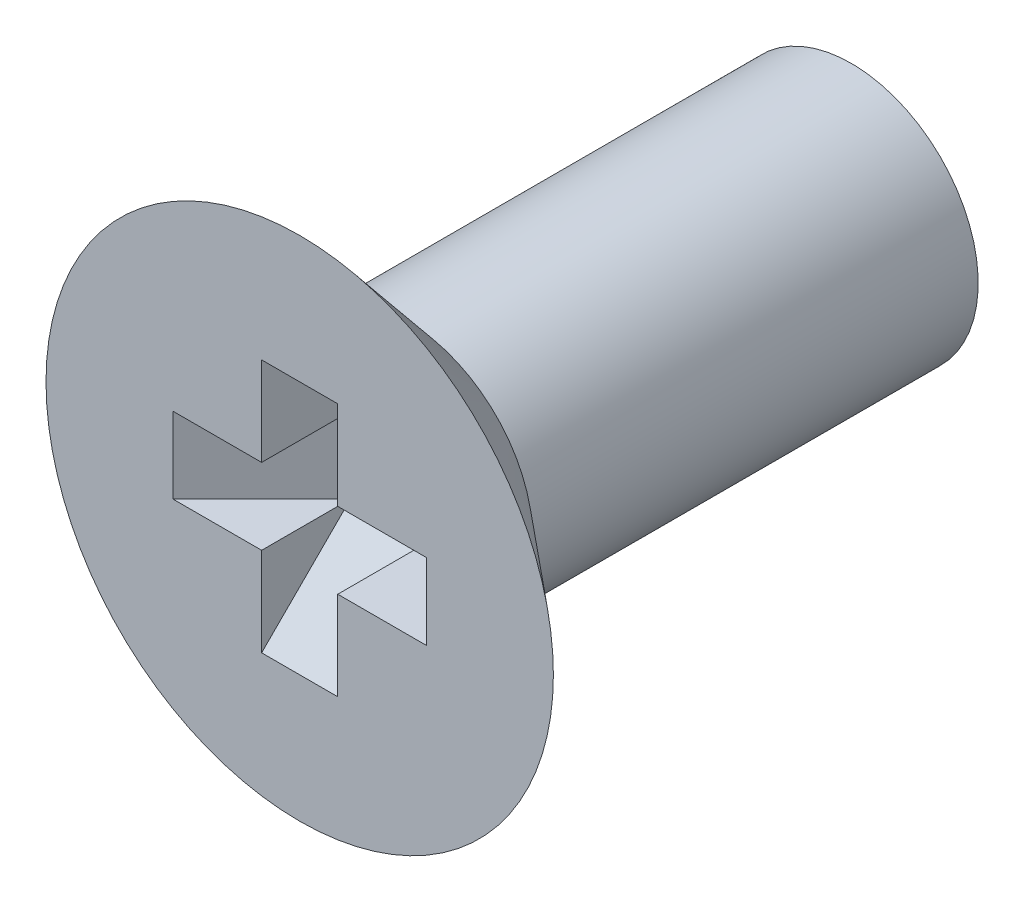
ISO-10303-21;
HEADER;
FILE_DESCRIPTION(('STEP AP214'),'2;1');
FILE_NAME('part.step','',(''),(''),'','','');
FILE_SCHEMA(('AUTOMOTIVE_DESIGN { 1 0 10303 214 1 1 1 1 }'));
ENDSEC;
DATA;
#1=APPLICATION_CONTEXT('core data for automotive mechanical design processes');
#2=APPLICATION_PROTOCOL_DEFINITION('international standard','automotive_design',2000,#1);
#3=PRODUCT_CONTEXT('',#1,'mechanical');
#4=PRODUCT('Part','Part','',(#3));
#5=PRODUCT_RELATED_PRODUCT_CATEGORY('part','',(#4));
#6=PRODUCT_DEFINITION_FORMATION('','',#4);
#7=PRODUCT_DEFINITION_CONTEXT('part definition',#1,'design');
#8=PRODUCT_DEFINITION('design','',#6,#7);
#9=PRODUCT_DEFINITION_SHAPE('','',#8);
#10=(LENGTH_UNIT() NAMED_UNIT(*) SI_UNIT(.MILLI.,.METRE.));
#11=(NAMED_UNIT(*) PLANE_ANGLE_UNIT() SI_UNIT($,.RADIAN.));
#12=(NAMED_UNIT(*) SI_UNIT($,.STERADIAN.) SOLID_ANGLE_UNIT());
#13=UNCERTAINTY_MEASURE_WITH_UNIT(LENGTH_MEASURE(1.E-05),#10,'distance_accuracy_value','');
#14=(GEOMETRIC_REPRESENTATION_CONTEXT(3) GLOBAL_UNCERTAINTY_ASSIGNED_CONTEXT((#13)) GLOBAL_UNIT_ASSIGNED_CONTEXT((#10,
#11,#12)) REPRESENTATION_CONTEXT('',''));
#15=CARTESIAN_POINT('',(0.,0.,0.));
#16=DIRECTION('',(0.,0.,1.));
#17=DIRECTION('',(1.,0.,0.));
#18=AXIS2_PLACEMENT_3D('',#15,#16,#17);
#19=CARTESIAN_POINT('',(-0.32766,-0.327659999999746,-0.76454));
#20=DIRECTION('',(0.,0.,-1.));
#21=DIRECTION('',(-1.,0.,0.));
#22=AXIS2_PLACEMENT_3D('',#19,#20,#21);
#23=PLANE('',#22);
#24=DIRECTION('',(0.,1.,0.));
#25=VECTOR('',#24,1.);
#26=CARTESIAN_POINT('',(0.32766,-0.32766,-0.76454));
#27=LINE('',#26,#25);
#28=CARTESIAN_POINT('',(0.32766,-0.327659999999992,-0.764539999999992));
#29=VERTEX_POINT('',#28);
#30=CARTESIAN_POINT('',(0.32766,0.327660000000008,-0.764540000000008));
#31=VERTEX_POINT('',#30);
#32=EDGE_CURVE('E87',#29,#31,#27,.T.);
#33=ORIENTED_EDGE('',*,*,#32,.T.);
#34=DIRECTION('',(1.,0.,0.));
#35=VECTOR('',#34,1.);
#36=CARTESIAN_POINT('',(-0.32766,0.327660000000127,-0.764540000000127));
#37=LINE('',#36,#35);
#38=CARTESIAN_POINT('',(-0.32766,0.327660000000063,-0.764540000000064));
#39=VERTEX_POINT('',#38);
#40=EDGE_CURVE('E174',#31,#39,#37,.F.);
#41=ORIENTED_EDGE('',*,*,#40,.T.);
#42=DIRECTION('',(0.,1.,0.));
#43=VECTOR('',#42,1.);
#44=CARTESIAN_POINT('',(-0.32766,-0.32766,-0.76454));
#45=LINE('',#44,#43);
#46=CARTESIAN_POINT('',(-0.32766,-0.327659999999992,-0.764539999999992));
#47=VERTEX_POINT('',#46);
#48=EDGE_CURVE('E114',#39,#47,#45,.F.);
#49=ORIENTED_EDGE('',*,*,#48,.T.);
#50=DIRECTION('',(1.,0.,0.));
#51=VECTOR('',#50,1.);
#52=CARTESIAN_POINT('',(-0.32766,-0.327659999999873,-0.764539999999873));
#53=LINE('',#52,#51);
#54=EDGE_CURVE('E111',#47,#29,#53,.T.);
#55=ORIENTED_EDGE('',*,*,#54,.T.);
#56=EDGE_LOOP('',(#33,#41,#49,#55));
#57=FACE_BOUND('',#56,.T.);
#58=ADVANCED_FACE('F24',(#57),#23,.F.);
#59=CARTESIAN_POINT('',(0.,-0.32766,0.));
#60=DIRECTION('',(0.,1.,0.));
#61=DIRECTION('',(0.,0.,1.));
#62=AXIS2_PLACEMENT_3D('',#59,#60,#61);
#63=PLANE('',#62);
#64=DIRECTION('',(0.,0.,-1.));
#65=VECTOR('',#64,1.);
#66=CARTESIAN_POINT('',(0.32766,-0.32766,0.));
#67=LINE('',#66,#65);
#68=CARTESIAN_POINT('',(0.32766,-0.32766,0.));
#69=VERTEX_POINT('',#68);
#70=EDGE_CURVE('E95',#29,#69,#67,.F.);
#71=ORIENTED_EDGE('',*,*,#70,.T.);
#72=DIRECTION('',(-1.,0.,0.));
#73=VECTOR('',#72,1.);
#74=CARTESIAN_POINT('',(0.,-0.32766,0.));
#75=LINE('',#74,#73);
#76=CARTESIAN_POINT('',(1.0922,-0.32766,0.));
#77=VERTEX_POINT('',#76);
#78=EDGE_CURVE('E98',#69,#77,#75,.F.);
#79=ORIENTED_EDGE('',*,*,#78,.T.);
#80=DIRECTION('',(-0.707106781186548,0.,-0.707106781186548));
#81=VECTOR('',#80,1.);
#82=CARTESIAN_POINT('',(1.0922,-0.32766,0.));
#83=LINE('',#82,#81);
#84=EDGE_CURVE('E92',#77,#29,#83,.T.);
#85=ORIENTED_EDGE('',*,*,#84,.T.);
#86=EDGE_LOOP('',(#71,#79,#85));
#87=FACE_BOUND('',#86,.T.);
#88=ADVANCED_FACE('F94',(#87),#63,.T.);
#89=CARTESIAN_POINT('',(1.0922,-0.32766,0.));
#90=DIRECTION('',(0.707106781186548,0.,-0.707106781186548));
#91=DIRECTION('',(-0.707106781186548,0.,-0.707106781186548));
#92=AXIS2_PLACEMENT_3D('',#89,#90,#91);
#93=PLANE('',#92);
#94=ORIENTED_EDGE('',*,*,#32,.F.);
#95=ORIENTED_EDGE('',*,*,#84,.F.);
#96=DIRECTION('',(0.,1.,0.));
#97=VECTOR('',#96,1.);
#98=CARTESIAN_POINT('',(1.0922,0.,0.));
#99=LINE('',#98,#97);
#100=CARTESIAN_POINT('',(1.0922,0.32766,0.));
#101=VERTEX_POINT('',#100);
#102=EDGE_CURVE('E151',#77,#101,#99,.T.);
#103=ORIENTED_EDGE('',*,*,#102,.T.);
#104=DIRECTION('',(-0.707106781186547,0.,-0.707106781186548));
#105=VECTOR('',#104,1.);
#106=CARTESIAN_POINT('',(1.0922,0.32766,0.));
#107=LINE('',#106,#105);
#108=EDGE_CURVE('E120',#101,#31,#107,.T.);
#109=ORIENTED_EDGE('',*,*,#108,.T.);
#110=EDGE_LOOP('',(#94,#95,#103,#109));
#111=FACE_BOUND('',#110,.T.);
#112=ADVANCED_FACE('F118',(#111),#93,.F.);
#113=CARTESIAN_POINT('',(0.,0.32766,0.));
#114=DIRECTION('',(0.,1.,0.));
#115=DIRECTION('',(0.,0.,1.));
#116=AXIS2_PLACEMENT_3D('',#113,#114,#115);
#117=PLANE('',#116);
#118=ORIENTED_EDGE('',*,*,#108,.F.);
#119=DIRECTION('',(-1.,0.,0.));
#120=VECTOR('',#119,1.);
#121=CARTESIAN_POINT('',(0.,0.32766,0.));
#122=LINE('',#121,#120);
#123=CARTESIAN_POINT('',(0.32766,0.32766,0.));
#124=VERTEX_POINT('',#123);
#125=EDGE_CURVE('E149',#101,#124,#122,.T.);
#126=ORIENTED_EDGE('',*,*,#125,.T.);
#127=DIRECTION('',(0.,0.,-1.));
#128=VECTOR('',#127,1.);
#129=CARTESIAN_POINT('',(0.32766,0.32766,0.));
#130=LINE('',#129,#128);
#131=EDGE_CURVE('E123',#124,#31,#130,.T.);
#132=ORIENTED_EDGE('',*,*,#131,.T.);
#133=EDGE_LOOP('',(#118,#126,#132));
#134=FACE_BOUND('',#133,.T.);
#135=ADVANCED_FACE('F177',(#134),#117,.F.);
#136=CARTESIAN_POINT('',(0.32766,0.,0.));
#137=DIRECTION('',(1.,0.,0.));
#138=DIRECTION('',(0.,0.,-1.));
#139=AXIS2_PLACEMENT_3D('',#136,#137,#138);
#140=PLANE('',#139);
#141=DIRECTION('',(0.,0.707106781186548,0.707106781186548));
#142=VECTOR('',#141,1.);
#143=CARTESIAN_POINT('',(0.32766,0.327660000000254,-0.76454));
#144=LINE('',#143,#142);
#145=CARTESIAN_POINT('',(0.32766,1.09220000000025,0.));
#146=VERTEX_POINT('',#145);
#147=EDGE_CURVE('E171',#146,#31,#144,.F.);
#148=ORIENTED_EDGE('',*,*,#147,.T.);
#149=ORIENTED_EDGE('',*,*,#131,.F.);
#150=DIRECTION('',(0.,1.,0.));
#151=VECTOR('',#150,1.);
#152=CARTESIAN_POINT('',(0.32766,0.,0.));
#153=LINE('',#152,#151);
#154=EDGE_CURVE('E147',#124,#146,#153,.T.);
#155=ORIENTED_EDGE('',*,*,#154,.T.);
#156=EDGE_LOOP('',(#148,#149,#155));
#157=FACE_BOUND('',#156,.T.);
#158=ADVANCED_FACE('F183',(#157),#140,.F.);
#159=CARTESIAN_POINT('',(-0.32766,0.327660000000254,-0.76454));
#160=DIRECTION('',(0.,0.707106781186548,-0.707106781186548));
#161=DIRECTION('',(0.,0.707106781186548,0.707106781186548));
#162=AXIS2_PLACEMENT_3D('',#159,#160,#161);
#163=PLANE('',#162);
#164=DIRECTION('',(-1.,0.,0.));
#165=VECTOR('',#164,1.);
#166=CARTESIAN_POINT('',(0.,1.09220000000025,0.));
#167=LINE('',#166,#165);
#168=CARTESIAN_POINT('',(-0.32766,1.09220000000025,0.));
#169=VERTEX_POINT('',#168);
#170=EDGE_CURVE('E145',#146,#169,#167,.T.);
#171=ORIENTED_EDGE('',*,*,#170,.T.);
#172=DIRECTION('',(0.,0.707106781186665,0.70710678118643));
#173=VECTOR('',#172,1.);
#174=CARTESIAN_POINT('',(-0.32766,0.32766,-0.76454));
#175=LINE('',#174,#173);
#176=EDGE_CURVE('E168',#39,#169,#175,.T.);
#177=ORIENTED_EDGE('',*,*,#176,.F.);
#178=ORIENTED_EDGE('',*,*,#40,.F.);
#179=ORIENTED_EDGE('',*,*,#147,.F.);
#180=EDGE_LOOP('',(#171,#177,#178,#179));
#181=FACE_BOUND('',#180,.T.);
#182=ADVANCED_FACE('F187',(#181),#163,.F.);
#183=CARTESIAN_POINT('',(-0.32766,0.,0.));
#184=DIRECTION('',(1.,0.,0.));
#185=DIRECTION('',(0.,0.,-1.));
#186=AXIS2_PLACEMENT_3D('',#183,#184,#185);
#187=PLANE('',#186);
#188=DIRECTION('',(0.,1.,0.));
#189=VECTOR('',#188,1.);
#190=CARTESIAN_POINT('',(-0.32766,0.,0.));
#191=LINE('',#190,#189);
#192=CARTESIAN_POINT('',(-0.32766,0.32766,0.));
#193=VERTEX_POINT('',#192);
#194=EDGE_CURVE('E143',#169,#193,#191,.F.);
#195=ORIENTED_EDGE('',*,*,#194,.T.);
#196=DIRECTION('',(0.,0.,1.));
#197=VECTOR('',#196,1.);
#198=CARTESIAN_POINT('',(-0.32766,0.32766,0.));
#199=LINE('',#198,#197);
#200=EDGE_CURVE('E165',#193,#39,#199,.F.);
#201=ORIENTED_EDGE('',*,*,#200,.T.);
#202=ORIENTED_EDGE('',*,*,#176,.T.);
#203=EDGE_LOOP('',(#195,#201,#202));
#204=FACE_BOUND('',#203,.T.);
#205=ADVANCED_FACE('F191',(#204),#187,.T.);
#206=CARTESIAN_POINT('',(0.,0.32766,0.));
#207=DIRECTION('',(0.,1.,0.));
#208=DIRECTION('',(0.,0.,1.));
#209=AXIS2_PLACEMENT_3D('',#206,#207,#208);
#210=PLANE('',#209);
#211=ORIENTED_EDGE('',*,*,#200,.F.);
#212=DIRECTION('',(-1.,0.,0.));
#213=VECTOR('',#212,1.);
#214=CARTESIAN_POINT('',(0.,0.32766,0.));
#215=LINE('',#214,#213);
#216=CARTESIAN_POINT('',(-1.0922,0.32766,0.));
#217=VERTEX_POINT('',#216);
#218=EDGE_CURVE('E141',#193,#217,#215,.T.);
#219=ORIENTED_EDGE('',*,*,#218,.T.);
#220=DIRECTION('',(-0.707106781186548,0.,0.707106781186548));
#221=VECTOR('',#220,1.);
#222=CARTESIAN_POINT('',(-0.32766,0.32766,-0.76454));
#223=LINE('',#222,#221);
#224=EDGE_CURVE('E162',#217,#39,#223,.F.);
#225=ORIENTED_EDGE('',*,*,#224,.T.);
#226=EDGE_LOOP('',(#211,#219,#225));
#227=FACE_BOUND('',#226,.T.);
#228=ADVANCED_FACE('F195',(#227),#210,.F.);
#229=CARTESIAN_POINT('',(-0.32766,-0.32766,-0.76454));
#230=DIRECTION('',(-0.707106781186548,0.,-0.707106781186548));
#231=DIRECTION('',(-0.707106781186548,0.,0.707106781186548));
#232=AXIS2_PLACEMENT_3D('',#229,#230,#231);
#233=PLANE('',#232);
#234=ORIENTED_EDGE('',*,*,#48,.F.);
#235=ORIENTED_EDGE('',*,*,#224,.F.);
#236=DIRECTION('',(0.,1.,0.));
#237=VECTOR('',#236,1.);
#238=CARTESIAN_POINT('',(-1.0922,0.,0.));
#239=LINE('',#238,#237);
#240=CARTESIAN_POINT('',(-1.0922,-0.32766,0.));
#241=VERTEX_POINT('',#240);
#242=EDGE_CURVE('E139',#217,#241,#239,.F.);
#243=ORIENTED_EDGE('',*,*,#242,.T.);
#244=DIRECTION('',(-0.707106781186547,0.,0.707106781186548));
#245=VECTOR('',#244,1.);
#246=CARTESIAN_POINT('',(-0.32766,-0.32766,-0.76454));
#247=LINE('',#246,#245);
#248=EDGE_CURVE('E158',#47,#241,#247,.T.);
#249=ORIENTED_EDGE('',*,*,#248,.F.);
#250=EDGE_LOOP('',(#234,#235,#243,#249));
#251=FACE_BOUND('',#250,.T.);
#252=ADVANCED_FACE('F198',(#251),#233,.F.);
#253=CARTESIAN_POINT('',(0.,-0.32766,0.));
#254=DIRECTION('',(0.,1.,0.));
#255=DIRECTION('',(0.,0.,1.));
#256=AXIS2_PLACEMENT_3D('',#253,#254,#255);
#257=PLANE('',#256);
#258=ORIENTED_EDGE('',*,*,#248,.T.);
#259=DIRECTION('',(-1.,0.,0.));
#260=VECTOR('',#259,1.);
#261=CARTESIAN_POINT('',(0.,-0.32766,0.));
#262=LINE('',#261,#260);
#263=CARTESIAN_POINT('',(-0.32766,-0.32766,0.));
#264=VERTEX_POINT('',#263);
#265=EDGE_CURVE('E137',#241,#264,#262,.F.);
#266=ORIENTED_EDGE('',*,*,#265,.T.);
#267=DIRECTION('',(0.,0.,-1.));
#268=VECTOR('',#267,1.);
#269=CARTESIAN_POINT('',(-0.32766,-0.32766,0.));
#270=LINE('',#269,#268);
#271=EDGE_CURVE('E116',#47,#264,#270,.F.);
#272=ORIENTED_EDGE('',*,*,#271,.F.);
#273=EDGE_LOOP('',(#258,#266,#272));
#274=FACE_BOUND('',#273,.T.);
#275=ADVANCED_FACE('F202',(#274),#257,.T.);
#276=CARTESIAN_POINT('',(-0.32766,0.,0.));
#277=DIRECTION('',(1.,0.,0.));
#278=DIRECTION('',(0.,0.,-1.));
#279=AXIS2_PLACEMENT_3D('',#276,#277,#278);
#280=PLANE('',#279);
#281=DIRECTION('',(0.,0.707106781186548,-0.707106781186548));
#282=VECTOR('',#281,1.);
#283=CARTESIAN_POINT('',(-0.32766,-1.09219999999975,0.));
#284=LINE('',#283,#282);
#285=CARTESIAN_POINT('',(-0.32766,-1.09219999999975,0.));
#286=VERTEX_POINT('',#285);
#287=EDGE_CURVE('E107',#286,#47,#284,.T.);
#288=ORIENTED_EDGE('',*,*,#287,.T.);
#289=ORIENTED_EDGE('',*,*,#271,.T.);
#290=DIRECTION('',(0.,1.,0.));
#291=VECTOR('',#290,1.);
#292=CARTESIAN_POINT('',(-0.32766,0.,0.));
#293=LINE('',#292,#291);
#294=EDGE_CURVE('E133',#264,#286,#293,.F.);
#295=ORIENTED_EDGE('',*,*,#294,.T.);
#296=EDGE_LOOP('',(#288,#289,#295));
#297=FACE_BOUND('',#296,.T.);
#298=ADVANCED_FACE('F205',(#297),#280,.T.);
#299=CARTESIAN_POINT('',(-0.32766,-1.09219999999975,0.));
#300=DIRECTION('',(0.,-0.707106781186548,-0.707106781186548));
#301=DIRECTION('',(0.,0.707106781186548,-0.707106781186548));
#302=AXIS2_PLACEMENT_3D('',#299,#300,#301);
#303=PLANE('',#302);
#304=DIRECTION('',(-1.,0.,0.));
#305=VECTOR('',#304,1.);
#306=CARTESIAN_POINT('',(0.,-1.09219999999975,0.));
#307=LINE('',#306,#305);
#308=CARTESIAN_POINT('',(0.32766,-1.09219999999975,0.));
#309=VERTEX_POINT('',#308);
#310=EDGE_CURVE('E42',#286,#309,#307,.F.);
#311=ORIENTED_EDGE('',*,*,#310,.T.);
#312=DIRECTION('',(0.,0.70710678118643,-0.707106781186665));
#313=VECTOR('',#312,1.);
#314=CARTESIAN_POINT('',(0.32766,-1.09219999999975,0.));
#315=LINE('',#314,#313);
#316=EDGE_CURVE('E104',#309,#29,#315,.T.);
#317=ORIENTED_EDGE('',*,*,#316,.T.);
#318=ORIENTED_EDGE('',*,*,#54,.F.);
#319=ORIENTED_EDGE('',*,*,#287,.F.);
#320=EDGE_LOOP('',(#311,#317,#318,#319));
#321=FACE_BOUND('',#320,.T.);
#322=ADVANCED_FACE('F110',(#321),#303,.F.);
#323=CARTESIAN_POINT('',(0.32766,0.,0.));
#324=DIRECTION('',(1.,0.,0.));
#325=DIRECTION('',(0.,0.,-1.));
#326=AXIS2_PLACEMENT_3D('',#323,#324,#325);
#327=PLANE('',#326);
#328=DIRECTION('',(0.,1.,0.));
#329=VECTOR('',#328,1.);
#330=CARTESIAN_POINT('',(0.32766,0.,0.));
#331=LINE('',#330,#329);
#332=EDGE_CURVE('E106',#309,#69,#331,.T.);
#333=ORIENTED_EDGE('',*,*,#332,.T.);
#334=ORIENTED_EDGE('',*,*,#70,.F.);
#335=ORIENTED_EDGE('',*,*,#316,.F.);
#336=EDGE_LOOP('',(#333,#334,#335));
#337=FACE_BOUND('',#336,.T.);
#338=ADVANCED_FACE('F103',(#337),#327,.F.);
#339=CARTESIAN_POINT('',(0.,0.,0.));
#340=DIRECTION('',(0.,0.,-1.));
#341=DIRECTION('',(-1.,0.,0.));
#342=AXIS2_PLACEMENT_3D('',#339,#340,#341);
#343=PLANE('',#342);
#344=ORIENTED_EDGE('',*,*,#310,.F.);
#345=ORIENTED_EDGE('',*,*,#294,.F.);
#346=ORIENTED_EDGE('',*,*,#265,.F.);
#347=ORIENTED_EDGE('',*,*,#242,.F.);
#348=ORIENTED_EDGE('',*,*,#218,.F.);
#349=ORIENTED_EDGE('',*,*,#194,.F.);
#350=ORIENTED_EDGE('',*,*,#170,.F.);
#351=ORIENTED_EDGE('',*,*,#154,.F.);
#352=ORIENTED_EDGE('',*,*,#125,.F.);
#353=ORIENTED_EDGE('',*,*,#102,.F.);
#354=ORIENTED_EDGE('',*,*,#78,.F.);
#355=ORIENTED_EDGE('',*,*,#332,.F.);
#356=EDGE_LOOP('',(#344,#345,#346,#347,#348,#349,#350,#351,#352,#353,#354,#355));
#357=FACE_BOUND('',#356,.T.);
#358=CARTESIAN_POINT('',(0.,0.,5.6843418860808E-11));
#359=DIRECTION('',(0.,0.,1.));
#360=DIRECTION('',(1.,0.,0.));
#361=AXIS2_PLACEMENT_3D('',#358,#359,#360);
#362=CIRCLE('',#361,2.18440000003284);
#363=CARTESIAN_POINT('',(2.18440000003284,0.,5.6843418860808E-11));
#364=VERTEX_POINT('',#363);
#365=EDGE_CURVE('E27',#364,#364,#362,.F.);
#366=ORIENTED_EDGE('',*,*,#365,.F.);
#367=EDGE_LOOP('',(#366));
#368=FACE_BOUND('',#367,.T.);
#369=ADVANCED_FACE('F207',(#357,#368),#343,.F.);
#370=CARTESIAN_POINT('',(0.,0.,-4.7498));
#371=DIRECTION('',(0.,0.,-1.));
#372=DIRECTION('',(-1.,0.,0.));
#373=AXIS2_PLACEMENT_3D('',#370,#371,#372);
#374=PLANE('',#373);
#375=CARTESIAN_POINT('',(0.,0.,-4.7498));
#376=DIRECTION('',(0.,0.,-1.));
#377=DIRECTION('',(-1.,0.,0.));
#378=AXIS2_PLACEMENT_3D('',#375,#376,#377);
#379=CIRCLE('',#378,1.0922);
#380=CARTESIAN_POINT('',(-1.0922,0.,-4.7498));
#381=VERTEX_POINT('',#380);
#382=EDGE_CURVE('E33',#381,#381,#379,.F.);
#383=ORIENTED_EDGE('',*,*,#382,.F.);
#384=EDGE_LOOP('',(#383));
#385=FACE_BOUND('',#384,.T.);
#386=ADVANCED_FACE('F210',(#385),#374,.T.);
#387=CARTESIAN_POINT('',(0.,0.,5.6843418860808E-11));
#388=DIRECTION('',(0.,0.,1.));
#389=DIRECTION('',(1.,0.,0.));
#390=AXIS2_PLACEMENT_3D('',#387,#388,#389);
#391=CONICAL_SURFACE('',#390,2.18440000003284,0.872664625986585);
#392=ORIENTED_EDGE('',*,*,#365,.T.);
#393=EDGE_LOOP('',(#392));
#394=FACE_BOUND('',#393,.T.);
#395=CARTESIAN_POINT('',(0.,0.,-0.916464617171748));
#396=DIRECTION('',(0.,0.,-1.));
#397=DIRECTION('',(-1.,0.,0.));
#398=AXIS2_PLACEMENT_3D('',#395,#396,#397);
#399=CIRCLE('',#398,1.0922);
#400=CARTESIAN_POINT('',(-1.0922,0.,-0.916464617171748));
#401=VERTEX_POINT('',#400);
#402=EDGE_CURVE('E13',#401,#401,#399,.T.);
#403=ORIENTED_EDGE('',*,*,#402,.F.);
#404=EDGE_LOOP('',(#403));
#405=FACE_BOUND('',#404,.T.);
#406=ADVANCED_FACE('F217',(#394,#405),#391,.T.);
#407=CARTESIAN_POINT('',(0.,0.,0.23749));
#408=DIRECTION('',(0.,0.,-1.));
#409=DIRECTION('',(-1.,0.,0.));
#410=AXIS2_PLACEMENT_3D('',#407,#408,#409);
#411=CYLINDRICAL_SURFACE('',#410,1.0922);
#412=ORIENTED_EDGE('',*,*,#402,.T.);
#413=EDGE_LOOP('',(#412));
#414=FACE_BOUND('',#413,.T.);
#415=ORIENTED_EDGE('',*,*,#382,.T.);
#416=EDGE_LOOP('',(#415));
#417=FACE_BOUND('',#416,.T.);
#418=ADVANCED_FACE('F221',(#414,#417),#411,.T.);
#419=CLOSED_SHELL('',(#58,#88,#112,#135,#158,#182,#205,#228,#252,#275,#298,#322,#338,#369,#386,
#406,#418));
#420=MANIFOLD_SOLID_BREP('B1',#419);
#421=ADVANCED_BREP_SHAPE_REPRESENTATION('',(#18,#420),#14);
#422=SHAPE_DEFINITION_REPRESENTATION(#9,#421);
ENDSEC;
END-ISO-10303-21;
